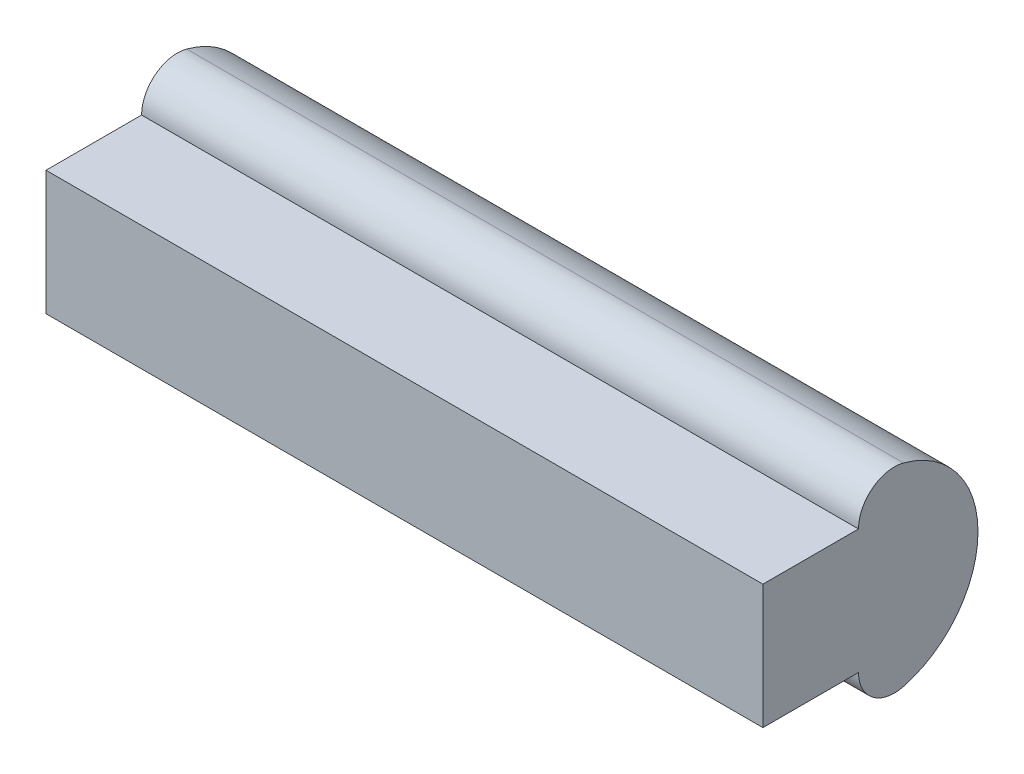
ISO-10303-21;
HEADER;
FILE_DESCRIPTION(('STEP AP214'),'2;1');
FILE_NAME('part.step','',(''),(''),'','','');
FILE_SCHEMA(('AUTOMOTIVE_DESIGN { 1 0 10303 214 1 1 1 1 }'));
ENDSEC;
DATA;
#1=APPLICATION_CONTEXT('core data for automotive mechanical design processes');
#2=APPLICATION_PROTOCOL_DEFINITION('international standard','automotive_design',2000,#1);
#3=PRODUCT_CONTEXT('',#1,'mechanical');
#4=PRODUCT('Part','Part','',(#3));
#5=PRODUCT_RELATED_PRODUCT_CATEGORY('part','',(#4));
#6=PRODUCT_DEFINITION_FORMATION('','',#4);
#7=PRODUCT_DEFINITION_CONTEXT('part definition',#1,'design');
#8=PRODUCT_DEFINITION('design','',#6,#7);
#9=PRODUCT_DEFINITION_SHAPE('','',#8);
#10=(LENGTH_UNIT() NAMED_UNIT(*) SI_UNIT(.MILLI.,.METRE.));
#11=(NAMED_UNIT(*) PLANE_ANGLE_UNIT() SI_UNIT($,.RADIAN.));
#12=(NAMED_UNIT(*) SI_UNIT($,.STERADIAN.) SOLID_ANGLE_UNIT());
#13=UNCERTAINTY_MEASURE_WITH_UNIT(LENGTH_MEASURE(1.E-05),#10,'distance_accuracy_value','');
#14=(GEOMETRIC_REPRESENTATION_CONTEXT(3) GLOBAL_UNCERTAINTY_ASSIGNED_CONTEXT((#13)) GLOBAL_UNIT_ASSIGNED_CONTEXT((#10,
#11,#12)) REPRESENTATION_CONTEXT('',''));
#15=CARTESIAN_POINT('',(0.,0.,0.));
#16=DIRECTION('',(0.,0.,1.));
#17=DIRECTION('',(1.,0.,0.));
#18=AXIS2_PLACEMENT_3D('',#15,#16,#17);
#19=CARTESIAN_POINT('',(300.,-26.,0.));
#20=DIRECTION('',(0.,-1.,0.));
#21=DIRECTION('',(0.,0.,-1.));
#22=AXIS2_PLACEMENT_3D('',#19,#20,#21);
#23=PLANE('',#22);
#24=DIRECTION('',(0.,0.,1.));
#25=VECTOR('',#24,1.);
#26=CARTESIAN_POINT('',(0.,-26.,0.));
#27=LINE('',#26,#25);
#28=CARTESIAN_POINT('',(0.,-26.,-40.));
#29=VERTEX_POINT('',#28);
#30=CARTESIAN_POINT('',(0.,-26.,0.));
#31=VERTEX_POINT('',#30);
#32=EDGE_CURVE('E128',#29,#31,#27,.T.);
#33=ORIENTED_EDGE('',*,*,#32,.F.);
#34=DIRECTION('',(-1.,0.,0.));
#35=VECTOR('',#34,1.);
#36=CARTESIAN_POINT('',(300.,-26.,-40.));
#37=LINE('',#36,#35);
#38=CARTESIAN_POINT('',(300.,-26.,-40.));
#39=VERTEX_POINT('',#38);
#40=EDGE_CURVE('E11',#39,#29,#37,.T.);
#41=ORIENTED_EDGE('',*,*,#40,.F.);
#42=DIRECTION('',(0.,0.,1.));
#43=VECTOR('',#42,1.);
#44=CARTESIAN_POINT('',(300.,-26.,0.));
#45=LINE('',#44,#43);
#46=CARTESIAN_POINT('',(300.,-26.,0.));
#47=VERTEX_POINT('',#46);
#48=EDGE_CURVE('E147',#39,#47,#45,.T.);
#49=ORIENTED_EDGE('',*,*,#48,.T.);
#50=DIRECTION('',(-1.,0.,0.));
#51=VECTOR('',#50,1.);
#52=CARTESIAN_POINT('',(300.,-26.,0.));
#53=LINE('',#52,#51);
#54=EDGE_CURVE('E58',#47,#31,#53,.T.);
#55=ORIENTED_EDGE('',*,*,#54,.T.);
#56=EDGE_LOOP('',(#33,#41,#49,#55));
#57=FACE_BOUND('',#56,.T.);
#58=ADVANCED_FACE('F41',(#57),#23,.T.);
#59=CARTESIAN_POINT('',(300.,-26.,-55.));
#60=DIRECTION('',(-1.,0.,0.));
#61=DIRECTION('',(0.,0.,1.));
#62=AXIS2_PLACEMENT_3D('',#59,#60,#61);
#63=CYLINDRICAL_SURFACE('',#62,15.);
#64=CARTESIAN_POINT('',(0.,-26.,-55.));
#65=DIRECTION('',(1.,0.,0.));
#66=DIRECTION('',(0.,0.,-1.));
#67=AXIS2_PLACEMENT_3D('',#64,#65,#66);
#68=CIRCLE('',#67,15.);
#69=CARTESIAN_POINT('',(0.,-40.4981412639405,-58.8475836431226));
#70=VERTEX_POINT('',#69);
#71=EDGE_CURVE('E131',#70,#29,#68,.F.);
#72=ORIENTED_EDGE('',*,*,#71,.F.);
#73=DIRECTION('',(-1.,0.,0.));
#74=VECTOR('',#73,1.);
#75=CARTESIAN_POINT('',(300.,-40.4981412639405,-58.8475836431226));
#76=LINE('',#75,#74);
#77=CARTESIAN_POINT('',(300.,-40.4981412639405,-58.8475836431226));
#78=VERTEX_POINT('',#77);
#79=EDGE_CURVE('E50',#78,#70,#76,.T.);
#80=ORIENTED_EDGE('',*,*,#79,.F.);
#81=CARTESIAN_POINT('',(300.,-26.,-55.));
#82=DIRECTION('',(1.,0.,0.));
#83=DIRECTION('',(0.,0.,-1.));
#84=AXIS2_PLACEMENT_3D('',#81,#82,#83);
#85=CIRCLE('',#84,15.);
#86=EDGE_CURVE('E163',#78,#39,#85,.F.);
#87=ORIENTED_EDGE('',*,*,#86,.T.);
#88=ORIENTED_EDGE('',*,*,#40,.T.);
#89=EDGE_LOOP('',(#72,#80,#87,#88));
#90=FACE_BOUND('',#89,.T.);
#91=ADVANCED_FACE('F162',(#90),#63,.T.);
#92=CARTESIAN_POINT('',(300.,0.,-48.1));
#93=DIRECTION('',(-1.,0.,0.));
#94=DIRECTION('',(0.,0.,1.));
#95=AXIS2_PLACEMENT_3D('',#92,#93,#94);
#96=CYLINDRICAL_SURFACE('',#95,41.9);
#97=CARTESIAN_POINT('',(0.,0.,-48.1));
#98=DIRECTION('',(1.,0.,0.));
#99=DIRECTION('',(0.,0.,-1.));
#100=AXIS2_PLACEMENT_3D('',#97,#98,#99);
#101=CIRCLE('',#100,41.9);
#102=CARTESIAN_POINT('',(0.,40.4981412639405,-58.8475836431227));
#103=VERTEX_POINT('',#102);
#104=EDGE_CURVE('E135',#70,#103,#101,.T.);
#105=ORIENTED_EDGE('',*,*,#104,.T.);
#106=DIRECTION('',(-1.,0.,0.));
#107=VECTOR('',#106,1.);
#108=CARTESIAN_POINT('',(300.,40.4981412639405,-58.8475836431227));
#109=LINE('',#108,#107);
#110=CARTESIAN_POINT('',(300.,40.4981412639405,-58.8475836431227));
#111=VERTEX_POINT('',#110);
#112=EDGE_CURVE('E118',#111,#103,#109,.T.);
#113=ORIENTED_EDGE('',*,*,#112,.F.);
#114=CARTESIAN_POINT('',(300.,0.,-48.1));
#115=DIRECTION('',(1.,0.,0.));
#116=DIRECTION('',(0.,0.,-1.));
#117=AXIS2_PLACEMENT_3D('',#114,#115,#116);
#118=CIRCLE('',#117,41.9);
#119=EDGE_CURVE('E104',#78,#111,#118,.T.);
#120=ORIENTED_EDGE('',*,*,#119,.F.);
#121=ORIENTED_EDGE('',*,*,#79,.T.);
#122=EDGE_LOOP('',(#105,#113,#120,#121));
#123=FACE_BOUND('',#122,.T.);
#124=ADVANCED_FACE('F156',(#123),#96,.T.);
#125=CARTESIAN_POINT('',(300.,26.,-55.));
#126=DIRECTION('',(-1.,0.,0.));
#127=DIRECTION('',(0.,0.,1.));
#128=AXIS2_PLACEMENT_3D('',#125,#126,#127);
#129=CYLINDRICAL_SURFACE('',#128,15.);
#130=CARTESIAN_POINT('',(0.,26.,-55.));
#131=DIRECTION('',(1.,0.,0.));
#132=DIRECTION('',(0.,0.,-1.));
#133=AXIS2_PLACEMENT_3D('',#130,#131,#132);
#134=CIRCLE('',#133,15.);
#135=CARTESIAN_POINT('',(0.,26.,-40.));
#136=VERTEX_POINT('',#135);
#137=EDGE_CURVE('E114',#103,#136,#134,.T.);
#138=ORIENTED_EDGE('',*,*,#137,.T.);
#139=DIRECTION('',(-1.,0.,0.));
#140=VECTOR('',#139,1.);
#141=CARTESIAN_POINT('',(300.,26.,-40.));
#142=LINE('',#141,#140);
#143=CARTESIAN_POINT('',(300.,26.,-40.));
#144=VERTEX_POINT('',#143);
#145=EDGE_CURVE('E111',#144,#136,#142,.T.);
#146=ORIENTED_EDGE('',*,*,#145,.F.);
#147=CARTESIAN_POINT('',(300.,26.,-55.));
#148=DIRECTION('',(1.,0.,0.));
#149=DIRECTION('',(0.,0.,-1.));
#150=AXIS2_PLACEMENT_3D('',#147,#148,#149);
#151=CIRCLE('',#150,15.);
#152=EDGE_CURVE('E96',#111,#144,#151,.T.);
#153=ORIENTED_EDGE('',*,*,#152,.F.);
#154=ORIENTED_EDGE('',*,*,#112,.T.);
#155=EDGE_LOOP('',(#138,#146,#153,#154));
#156=FACE_BOUND('',#155,.T.);
#157=ADVANCED_FACE('F112',(#156),#129,.T.);
#158=CARTESIAN_POINT('',(300.,26.,0.));
#159=DIRECTION('',(0.,-1.,0.));
#160=DIRECTION('',(0.,0.,-1.));
#161=AXIS2_PLACEMENT_3D('',#158,#159,#160);
#162=PLANE('',#161);
#163=DIRECTION('',(0.,0.,1.));
#164=VECTOR('',#163,1.);
#165=CARTESIAN_POINT('',(0.,26.,0.));
#166=LINE('',#165,#164);
#167=CARTESIAN_POINT('',(0.,26.,0.));
#168=VERTEX_POINT('',#167);
#169=EDGE_CURVE('E140',#136,#168,#166,.T.);
#170=ORIENTED_EDGE('',*,*,#169,.T.);
#171=DIRECTION('',(-1.,0.,0.));
#172=VECTOR('',#171,1.);
#173=CARTESIAN_POINT('',(300.,26.,0.));
#174=LINE('',#173,#172);
#175=CARTESIAN_POINT('',(300.,26.,0.));
#176=VERTEX_POINT('',#175);
#177=EDGE_CURVE('E78',#176,#168,#174,.T.);
#178=ORIENTED_EDGE('',*,*,#177,.F.);
#179=DIRECTION('',(0.,0.,1.));
#180=VECTOR('',#179,1.);
#181=CARTESIAN_POINT('',(300.,26.,0.));
#182=LINE('',#181,#180);
#183=EDGE_CURVE('E101',#144,#176,#182,.T.);
#184=ORIENTED_EDGE('',*,*,#183,.F.);
#185=ORIENTED_EDGE('',*,*,#145,.T.);
#186=EDGE_LOOP('',(#170,#178,#184,#185));
#187=FACE_BOUND('',#186,.T.);
#188=ADVANCED_FACE('F120',(#187),#162,.F.);
#189=CARTESIAN_POINT('',(300.,0.,0.));
#190=DIRECTION('',(0.,0.,1.));
#191=DIRECTION('',(1.,0.,0.));
#192=AXIS2_PLACEMENT_3D('',#189,#190,#191);
#193=PLANE('',#192);
#194=DIRECTION('',(0.,1.,0.));
#195=VECTOR('',#194,1.);
#196=CARTESIAN_POINT('',(0.,0.,0.));
#197=LINE('',#196,#195);
#198=EDGE_CURVE('E143',#31,#168,#197,.T.);
#199=ORIENTED_EDGE('',*,*,#198,.F.);
#200=ORIENTED_EDGE('',*,*,#54,.F.);
#201=DIRECTION('',(0.,1.,0.));
#202=VECTOR('',#201,1.);
#203=CARTESIAN_POINT('',(300.,0.,0.));
#204=LINE('',#203,#202);
#205=EDGE_CURVE('E122',#47,#176,#204,.T.);
#206=ORIENTED_EDGE('',*,*,#205,.T.);
#207=ORIENTED_EDGE('',*,*,#177,.T.);
#208=EDGE_LOOP('',(#199,#200,#206,#207));
#209=FACE_BOUND('',#208,.T.);
#210=ADVANCED_FACE('F164',(#209),#193,.T.);
#211=CARTESIAN_POINT('',(300.,0.,0.));
#212=DIRECTION('',(1.,0.,0.));
#213=DIRECTION('',(0.,0.,-1.));
#214=AXIS2_PLACEMENT_3D('',#211,#212,#213);
#215=PLANE('',#214);
#216=ORIENTED_EDGE('',*,*,#48,.F.);
#217=ORIENTED_EDGE('',*,*,#86,.F.);
#218=ORIENTED_EDGE('',*,*,#119,.T.);
#219=ORIENTED_EDGE('',*,*,#152,.T.);
#220=ORIENTED_EDGE('',*,*,#183,.T.);
#221=ORIENTED_EDGE('',*,*,#205,.F.);
#222=EDGE_LOOP('',(#216,#217,#218,#219,#220,#221));
#223=FACE_BOUND('',#222,.T.);
#224=ADVANCED_FACE('F98',(#223),#215,.T.);
#225=CARTESIAN_POINT('',(0.,0.,0.));
#226=DIRECTION('',(1.,0.,0.));
#227=DIRECTION('',(0.,0.,-1.));
#228=AXIS2_PLACEMENT_3D('',#225,#226,#227);
#229=PLANE('',#228);
#230=ORIENTED_EDGE('',*,*,#32,.T.);
#231=ORIENTED_EDGE('',*,*,#198,.T.);
#232=ORIENTED_EDGE('',*,*,#169,.F.);
#233=ORIENTED_EDGE('',*,*,#137,.F.);
#234=ORIENTED_EDGE('',*,*,#104,.F.);
#235=ORIENTED_EDGE('',*,*,#71,.T.);
#236=EDGE_LOOP('',(#230,#231,#232,#233,#234,#235));
#237=FACE_BOUND('',#236,.T.);
#238=ADVANCED_FACE('F161',(#237),#229,.F.);
#239=CLOSED_SHELL('',(#58,#91,#124,#157,#188,#210,#224,#238));
#240=MANIFOLD_SOLID_BREP('B2',#239);
#241=ADVANCED_BREP_SHAPE_REPRESENTATION('',(#18,#240),#14);
#242=SHAPE_DEFINITION_REPRESENTATION(#9,#241);
ENDSEC;
END-ISO-10303-21;
